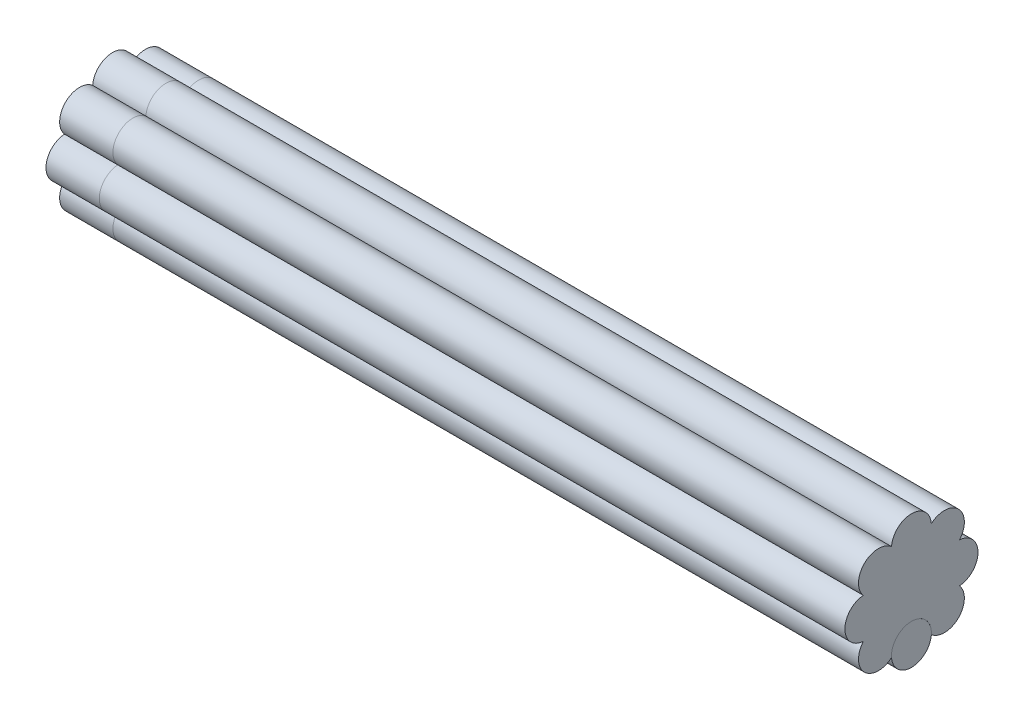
from build123d import *

# Parameters (mm, degrees)
SALIENTE_EXTRUIR1_DEPTH = 280
CROQUIS3_R              = 7.5
SALIENTE_EXTRUIR2_DEPTH = 280
SALIENTE_EXTRUIR3_DEPTH = 20


with BuildPart() as part:
    # Croquis2 → Saliente-Extruir1 (new body)
    with BuildSketch(Plane(origin=(0, 0, 0), x_dir=(0, 0, -1), z_dir=(1, 0, 0))):
        with BuildLine():
            ThreePointArc((7.47931345, 18.056659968), (0, 25), (-7.47931345, 18.056659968))
            ThreePointArc((-7.47931345, 18.056659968), (-17.67766953, 17.67766953), (-18.056659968, 7.47931345))
            ThreePointArc((-18.056659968, 7.47931345), (-25, 0), (-18.056659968, -7.47931345))
            ThreePointArc((-18.056659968, -7.47931345), (-17.67766953, -17.67766953), (-7.47931345, -18.056659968))
            ThreePointArc((-7.47931345, -18.056659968), (0, -10), (7.47931345, -18.056659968))
            ThreePointArc((7.47931345, -18.056659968), (17.67766953, -17.67766953), (18.056659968, -7.47931345))
            ThreePointArc((18.056659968, -7.47931345), (25, 0), (18.056659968, 7.47931345))
            ThreePointArc((18.056659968, 7.47931345), (17.67766953, 17.67766953), (7.47931345, 18.056659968))
        make_face()
    extrude(amount=-SALIENTE_EXTRUIR1_DEPTH)


with BuildPart() as body_2:
    # Croquis3 → Saliente-Extruir2 (new body)
    with BuildSketch(Plane(origin=(0, 0, 0), x_dir=(0, 0, -1), z_dir=(1, 0, 0))):
        with Locations((0, -17.5)):
            Circle(CROQUIS3_R)
    extrude(amount=-SALIENTE_EXTRUIR2_DEPTH)


with BuildPart() as body_3:
    # Croquis4 → Saliente-Extruir3 (new body)
    with BuildSketch(Plane.ZY.offset(280)):
        with BuildLine():
            ThreePointArc((-7.47931345, -18.056659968), (0, -25), (7.47931345, -18.056659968))
            ThreePointArc((7.47931345, -18.056659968), (17.67766953, -17.67766953), (18.056659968, -7.47931345))
            ThreePointArc((18.056659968, -7.47931345), (25, 0), (18.056659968, 7.47931345))
            ThreePointArc((18.056659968, 7.47931345), (17.67766953, 17.67766953), (7.47931345, 18.056659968))
            ThreePointArc((7.47931345, 18.056659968), (0, 25), (-7.47931345, 18.056659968))
            ThreePointArc((-7.47931345, 18.056659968), (-17.67766953, 17.67766953), (-18.056659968, 7.47931345))
            ThreePointArc((-18.056659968, 7.47931345), (-25, 0), (-18.056659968, -7.47931345))
            ThreePointArc((-18.056659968, -7.47931345), (-17.67766953, -17.67766953), (-7.47931345, -18.056659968))
        make_face()
    extrude(amount=SALIENTE_EXTRUIR3_DEPTH)


solid = Compound([part.part, body_2.part, body_3.part])
